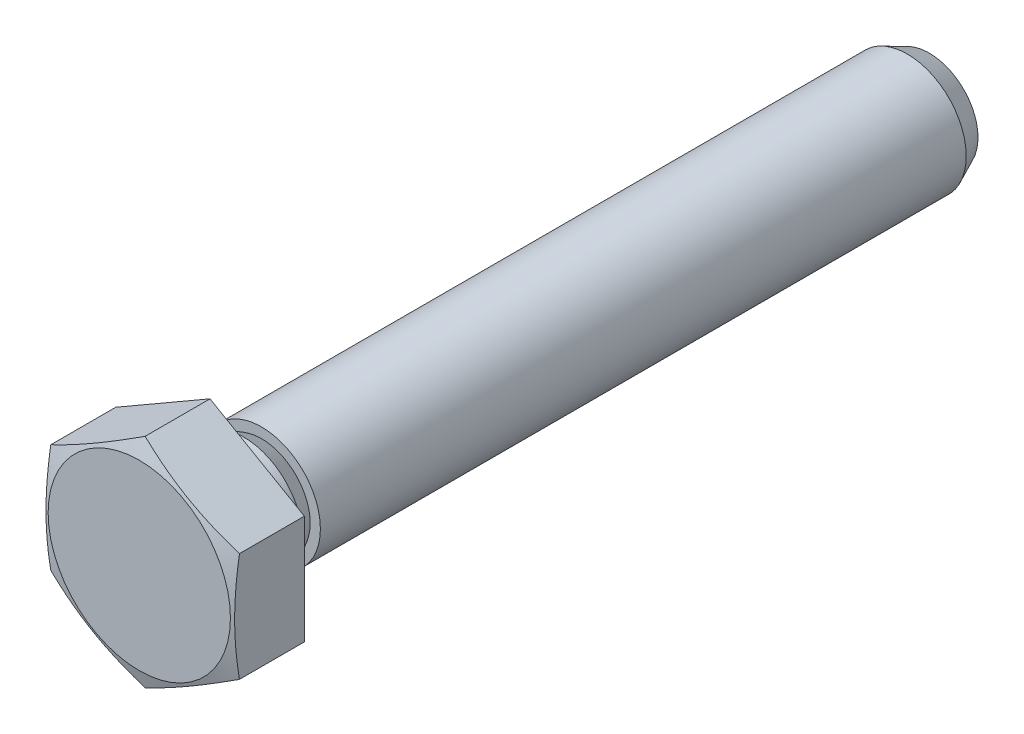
ISO-10303-21;
HEADER;
FILE_DESCRIPTION(('STEP AP214'),'2;1');
FILE_NAME('part.step','',(''),(''),'','','');
FILE_SCHEMA(('AUTOMOTIVE_DESIGN { 1 0 10303 214 1 1 1 1 }'));
ENDSEC;
DATA;
#1=APPLICATION_CONTEXT('core data for automotive mechanical design processes');
#2=APPLICATION_PROTOCOL_DEFINITION('international standard','automotive_design',2000,#1);
#3=PRODUCT_CONTEXT('',#1,'mechanical');
#4=PRODUCT('Part','Part','',(#3));
#5=PRODUCT_RELATED_PRODUCT_CATEGORY('part','',(#4));
#6=PRODUCT_DEFINITION_FORMATION('','',#4);
#7=PRODUCT_DEFINITION_CONTEXT('part definition',#1,'design');
#8=PRODUCT_DEFINITION('design','',#6,#7);
#9=PRODUCT_DEFINITION_SHAPE('','',#8);
#10=(LENGTH_UNIT() NAMED_UNIT(*) SI_UNIT(.MILLI.,.METRE.));
#11=(NAMED_UNIT(*) PLANE_ANGLE_UNIT() SI_UNIT($,.RADIAN.));
#12=(NAMED_UNIT(*) SI_UNIT($,.STERADIAN.) SOLID_ANGLE_UNIT());
#13=UNCERTAINTY_MEASURE_WITH_UNIT(LENGTH_MEASURE(1.E-05),#10,'distance_accuracy_value','');
#14=(GEOMETRIC_REPRESENTATION_CONTEXT(3) GLOBAL_UNCERTAINTY_ASSIGNED_CONTEXT((#13)) GLOBAL_UNIT_ASSIGNED_CONTEXT((#10,
#11,#12)) REPRESENTATION_CONTEXT('',''));
#15=CARTESIAN_POINT('',(0.,0.,0.));
#16=DIRECTION('',(0.,0.,1.));
#17=DIRECTION('',(1.,0.,0.));
#18=AXIS2_PLACEMENT_3D('',#15,#16,#17);
#19=CARTESIAN_POINT('',(0.,0.,0.5));
#20=DIRECTION('',(0.,0.,1.));
#21=DIRECTION('',(1.,0.,0.));
#22=AXIS2_PLACEMENT_3D('',#19,#20,#21);
#23=TOROIDAL_SURFACE('',#22,2.85,0.5);
#24=CARTESIAN_POINT('',(0.,0.,0.5));
#25=DIRECTION('',(0.,0.,1.));
#26=DIRECTION('',(1.,0.,0.));
#27=AXIS2_PLACEMENT_3D('',#24,#25,#26);
#28=CIRCLE('',#27,3.35);
#29=CARTESIAN_POINT('',(3.35,0.,0.500000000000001));
#30=VERTEX_POINT('',#29);
#31=EDGE_CURVE('E11',#30,#30,#28,.T.);
#32=ORIENTED_EDGE('',*,*,#31,.F.);
#33=EDGE_LOOP('',(#32));
#34=FACE_BOUND('',#33,.T.);
#35=CARTESIAN_POINT('',(0.,0.,0.));
#36=DIRECTION('',(0.,0.,1.));
#37=DIRECTION('',(1.,0.,0.));
#38=AXIS2_PLACEMENT_3D('',#35,#36,#37);
#39=CIRCLE('',#38,2.85);
#40=CARTESIAN_POINT('',(2.85,0.,0.));
#41=VERTEX_POINT('',#40);
#42=EDGE_CURVE('E24',#41,#41,#39,.T.);
#43=ORIENTED_EDGE('',*,*,#42,.T.);
#44=EDGE_LOOP('',(#43));
#45=FACE_BOUND('',#44,.T.);
#46=ADVANCED_FACE('F17',(#34,#45),#23,.T.);
#47=CARTESIAN_POINT('',(0.,2.84999999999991,0.));
#48=DIRECTION('',(0.,0.,-1.));
#49=DIRECTION('',(-1.,0.,0.));
#50=AXIS2_PLACEMENT_3D('',#47,#48,#49);
#51=PLANE('',#50);
#52=CARTESIAN_POINT('',(0.,0.,0.));
#53=DIRECTION('',(0.,0.,1.));
#54=DIRECTION('',(1.,0.,0.));
#55=AXIS2_PLACEMENT_3D('',#52,#53,#54);
#56=CIRCLE('',#55,2.75);
#57=CARTESIAN_POINT('',(2.75,0.,0.));
#58=VERTEX_POINT('',#57);
#59=EDGE_CURVE('E118',#58,#58,#56,.T.);
#60=ORIENTED_EDGE('',*,*,#59,.T.);
#61=EDGE_LOOP('',(#60));
#62=FACE_BOUND('',#61,.T.);
#63=ORIENTED_EDGE('',*,*,#42,.F.);
#64=EDGE_LOOP('',(#63));
#65=FACE_BOUND('',#64,.T.);
#66=ADVANCED_FACE('F124',(#62,#65),#51,.T.);
#67=CARTESIAN_POINT('',(0.,1.11022302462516E-13,-0.250000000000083));
#68=DIRECTION('',(0.,0.,1.));
#69=DIRECTION('',(1.,0.,0.));
#70=AXIS2_PLACEMENT_3D('',#67,#68,#69);
#71=TOROIDAL_SURFACE('',#70,2.75,0.25);
#72=CARTESIAN_POINT('',(0.,1.11022302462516E-13,-0.250000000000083));
#73=DIRECTION('',(0.,0.,1.));
#74=DIRECTION('',(1.,0.,0.));
#75=AXIS2_PLACEMENT_3D('',#72,#73,#74);
#76=CIRCLE('',#75,2.5);
#77=CARTESIAN_POINT('',(2.5,1.10476948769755E-13,-0.250000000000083));
#78=VERTEX_POINT('',#77);
#79=EDGE_CURVE('E115',#78,#78,#76,.T.);
#80=ORIENTED_EDGE('',*,*,#79,.T.);
#81=EDGE_LOOP('',(#80));
#82=FACE_BOUND('',#81,.T.);
#83=ORIENTED_EDGE('',*,*,#59,.F.);
#84=EDGE_LOOP('',(#83));
#85=FACE_BOUND('',#84,.T.);
#86=ADVANCED_FACE('F126',(#82,#85),#71,.F.);
#87=CARTESIAN_POINT('',(0.,0.,0.5));
#88=DIRECTION('',(0.,0.,1.));
#89=DIRECTION('',(1.,0.,0.));
#90=AXIS2_PLACEMENT_3D('',#87,#88,#89);
#91=CYLINDRICAL_SURFACE('',#90,2.5);
#92=CARTESIAN_POINT('',(0.,1.66533453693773E-13,-0.930022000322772));
#93=DIRECTION('',(0.,0.,1.));
#94=DIRECTION('',(1.,0.,0.));
#95=AXIS2_PLACEMENT_3D('',#92,#93,#94);
#96=CIRCLE('',#95,2.5);
#97=CARTESIAN_POINT('',(2.49999999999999,1.65988100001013E-13,-0.930022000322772));
#98=VERTEX_POINT('',#97);
#99=EDGE_CURVE('E112',#98,#98,#96,.T.);
#100=ORIENTED_EDGE('',*,*,#99,.T.);
#101=EDGE_LOOP('',(#100));
#102=FACE_BOUND('',#101,.T.);
#103=ORIENTED_EDGE('',*,*,#79,.F.);
#104=EDGE_LOOP('',(#103));
#105=FACE_BOUND('',#104,.T.);
#106=ADVANCED_FACE('F133',(#102,#105),#91,.T.);
#107=CARTESIAN_POINT('',(0.,1.66533453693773E-13,-0.930022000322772));
#108=DIRECTION('',(0.,0.,1.));
#109=DIRECTION('',(1.,0.,0.));
#110=AXIS2_PLACEMENT_3D('',#107,#108,#109);
#111=CONICAL_SURFACE('',#110,2.5,0.523598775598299);
#112=CARTESIAN_POINT('',(0.,0.,-1.68000000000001));
#113=DIRECTION('',(0.,0.,1.));
#114=DIRECTION('',(1.,0.,0.));
#115=AXIS2_PLACEMENT_3D('',#112,#113,#114);
#116=CIRCLE('',#115,2.067);
#117=CARTESIAN_POINT('',(2.067,0.,-1.68000000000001));
#118=VERTEX_POINT('',#117);
#119=EDGE_CURVE('E109',#118,#118,#116,.T.);
#120=ORIENTED_EDGE('',*,*,#119,.T.);
#121=EDGE_LOOP('',(#120));
#122=FACE_BOUND('',#121,.T.);
#123=ORIENTED_EDGE('',*,*,#99,.F.);
#124=EDGE_LOOP('',(#123));
#125=FACE_BOUND('',#124,.T.);
#126=ADVANCED_FACE('F140',(#122,#125),#111,.T.);
#127=CARTESIAN_POINT('',(0.,2.06700000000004,-1.68000000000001));
#128=DIRECTION('',(0.,0.,1.));
#129=DIRECTION('',(1.,0.,0.));
#130=AXIS2_PLACEMENT_3D('',#127,#128,#129);
#131=PLANE('',#130);
#132=CARTESIAN_POINT('',(0.,0.,-1.68000000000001));
#133=DIRECTION('',(0.,0.,1.));
#134=DIRECTION('',(1.,0.,0.));
#135=AXIS2_PLACEMENT_3D('',#132,#133,#134);
#136=CIRCLE('',#135,2.5);
#137=CARTESIAN_POINT('',(2.5,0.,-1.68000000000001));
#138=VERTEX_POINT('',#137);
#139=EDGE_CURVE('E106',#138,#138,#136,.T.);
#140=ORIENTED_EDGE('',*,*,#139,.T.);
#141=EDGE_LOOP('',(#140));
#142=FACE_BOUND('',#141,.T.);
#143=ORIENTED_EDGE('',*,*,#119,.F.);
#144=EDGE_LOOP('',(#143));
#145=FACE_BOUND('',#144,.T.);
#146=ADVANCED_FACE('F144',(#142,#145),#131,.T.);
#147=CARTESIAN_POINT('',(0.,0.,0.5));
#148=DIRECTION('',(0.,0.,1.));
#149=DIRECTION('',(1.,0.,0.));
#150=AXIS2_PLACEMENT_3D('',#147,#148,#149);
#151=CYLINDRICAL_SURFACE('',#150,2.5);
#152=CARTESIAN_POINT('',(0.,1.11022302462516E-13,-29.0670000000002));
#153=DIRECTION('',(0.,0.,1.));
#154=DIRECTION('',(1.,0.,0.));
#155=AXIS2_PLACEMENT_3D('',#152,#153,#154);
#156=CIRCLE('',#155,2.5);
#157=CARTESIAN_POINT('',(2.5,1.10476948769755E-13,-29.0670000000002));
#158=VERTEX_POINT('',#157);
#159=EDGE_CURVE('E103',#158,#158,#156,.T.);
#160=ORIENTED_EDGE('',*,*,#159,.T.);
#161=EDGE_LOOP('',(#160));
#162=FACE_BOUND('',#161,.T.);
#163=ORIENTED_EDGE('',*,*,#139,.F.);
#164=EDGE_LOOP('',(#163));
#165=FACE_BOUND('',#164,.T.);
#166=ADVANCED_FACE('F148',(#162,#165),#151,.T.);
#167=CARTESIAN_POINT('',(0.,1.11022302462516E-13,-29.0670000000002));
#168=DIRECTION('',(0.,0.,1.));
#169=DIRECTION('',(1.,0.,0.));
#170=AXIS2_PLACEMENT_3D('',#167,#168,#169);
#171=CONICAL_SURFACE('',#170,2.5,0.43451274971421);
#172=CARTESIAN_POINT('',(0.,-1.11022302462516E-13,-30.0000000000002));
#173=DIRECTION('',(0.,0.,1.));
#174=DIRECTION('',(1.,0.,0.));
#175=AXIS2_PLACEMENT_3D('',#172,#173,#174);
#176=CIRCLE('',#175,2.067);
#177=CARTESIAN_POINT('',(2.067,-1.1147320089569E-13,-30.0000000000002));
#178=VERTEX_POINT('',#177);
#179=EDGE_CURVE('E100',#178,#178,#176,.T.);
#180=ORIENTED_EDGE('',*,*,#179,.T.);
#181=EDGE_LOOP('',(#180));
#182=FACE_BOUND('',#181,.T.);
#183=ORIENTED_EDGE('',*,*,#159,.F.);
#184=EDGE_LOOP('',(#183));
#185=FACE_BOUND('',#184,.T.);
#186=ADVANCED_FACE('F152',(#182,#185),#171,.T.);
#187=CARTESIAN_POINT('',(0.,2.06700000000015,-30.));
#188=DIRECTION('',(0.,0.,-1.));
#189=DIRECTION('',(-1.,0.,0.));
#190=AXIS2_PLACEMENT_3D('',#187,#188,#189);
#191=PLANE('',#190);
#192=ORIENTED_EDGE('',*,*,#179,.F.);
#193=EDGE_LOOP('',(#192));
#194=FACE_BOUND('',#193,.T.);
#195=ADVANCED_FACE('F156',(#194),#191,.T.);
#196=CARTESIAN_POINT('',(-4.,-2.30940000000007,0.499999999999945));
#197=DIRECTION('',(0.,0.,-1.));
#198=DIRECTION('',(-1.,0.,0.));
#199=AXIS2_PLACEMENT_3D('',#196,#197,#198);
#200=PLANE('',#199);
#201=DIRECTION('',(0.,-1.,0.));
#202=VECTOR('',#201,1.);
#203=CARTESIAN_POINT('',(-4.,2.30940000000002,0.5));
#204=LINE('',#203,#202);
#205=CARTESIAN_POINT('',(-4.,2.30940000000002,0.5));
#206=VERTEX_POINT('',#205);
#207=CARTESIAN_POINT('',(-4.,-2.30940000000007,0.499999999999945));
#208=VERTEX_POINT('',#207);
#209=EDGE_CURVE('E83',#206,#208,#204,.T.);
#210=ORIENTED_EDGE('',*,*,#209,.F.);
#211=DIRECTION('',(0.866025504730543,0.49999982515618,0.));
#212=VECTOR('',#211,1.);
#213=CARTESIAN_POINT('',(-4.,2.30940000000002,0.5));
#214=LINE('',#213,#212);
#215=CARTESIAN_POINT('',(0.,4.61880000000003,0.499999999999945));
#216=VERTEX_POINT('',#215);
#217=EDGE_CURVE('E88',#206,#216,#214,.T.);
#218=ORIENTED_EDGE('',*,*,#217,.T.);
#219=DIRECTION('',(0.866025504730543,-0.499999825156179,0.));
#220=VECTOR('',#219,1.);
#221=CARTESIAN_POINT('',(0.,4.61880000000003,0.499999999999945));
#222=LINE('',#221,#220);
#223=CARTESIAN_POINT('',(4.00000000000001,2.30939999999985,0.499999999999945));
#224=VERTEX_POINT('',#223);
#225=EDGE_CURVE('E94',#216,#224,#222,.T.);
#226=ORIENTED_EDGE('',*,*,#225,.T.);
#227=DIRECTION('',(0.,-1.,0.));
#228=VECTOR('',#227,1.);
#229=CARTESIAN_POINT('',(4.00000000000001,2.30939999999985,0.499999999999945));
#230=LINE('',#229,#228);
#231=CARTESIAN_POINT('',(4.,-2.30939999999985,0.499999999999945));
#232=VERTEX_POINT('',#231);
#233=EDGE_CURVE('E246',#224,#232,#230,.T.);
#234=ORIENTED_EDGE('',*,*,#233,.T.);
#235=DIRECTION('',(-0.866025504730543,-0.49999982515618,0.));
#236=VECTOR('',#235,1.);
#237=CARTESIAN_POINT('',(4.,-2.30939999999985,0.499999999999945));
#238=LINE('',#237,#236);
#239=CARTESIAN_POINT('',(0.,-4.61880000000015,0.499999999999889));
#240=VERTEX_POINT('',#239);
#241=EDGE_CURVE('E232',#232,#240,#238,.T.);
#242=ORIENTED_EDGE('',*,*,#241,.T.);
#243=DIRECTION('',(-0.866025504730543,0.499999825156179,0.));
#244=VECTOR('',#243,1.);
#245=CARTESIAN_POINT('',(0.,-4.61880000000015,0.499999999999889));
#246=LINE('',#245,#244);
#247=EDGE_CURVE('E230',#240,#208,#246,.T.);
#248=ORIENTED_EDGE('',*,*,#247,.T.);
#249=EDGE_LOOP('',(#210,#218,#226,#234,#242,#248));
#250=FACE_BOUND('',#249,.T.);
#251=ORIENTED_EDGE('',*,*,#31,.T.);
#252=EDGE_LOOP('',(#251));
#253=FACE_BOUND('',#252,.T.);
#254=ADVANCED_FACE('F160',(#250,#253),#200,.T.);
#255=CARTESIAN_POINT('',(-4.,2.30940000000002,0.5));
#256=DIRECTION('',(-1.,0.,0.));
#257=DIRECTION('',(0.,0.,1.));
#258=AXIS2_PLACEMENT_3D('',#255,#256,#257);
#259=PLANE('',#258);
#260=CARTESIAN_POINT('',(-4.,2.66662995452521,3.19024582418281));
#261=CARTESIAN_POINT('',(-4.,2.48418475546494,3.22350153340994));
#262=CARTESIAN_POINT('',(-4.,2.30129241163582,3.25449531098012));
#263=CARTESIAN_POINT('',(-4.,1.93455333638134,3.31090755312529));
#264=CARTESIAN_POINT('',(-4.,1.75070613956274,3.33632297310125));
#265=CARTESIAN_POINT('',(-4.,1.38237526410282,3.38046702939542));
#266=CARTESIAN_POINT('',(-4.,1.19789237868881,3.39920214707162));
#267=CARTESIAN_POINT('',(-4.,0.82833495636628,3.42902381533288));
#268=CARTESIAN_POINT('',(-4.,0.643260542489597,3.44011186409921));
#269=CARTESIAN_POINT('',(-4.,0.275434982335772,3.45386479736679));
#270=CARTESIAN_POINT('',(-4.,0.0926883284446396,3.45664750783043));
#271=CARTESIAN_POINT('',(-4.,-0.272751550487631,3.45394498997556));
#272=CARTESIAN_POINT('',(-4.,-0.455444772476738,3.44845935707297));
#273=CARTESIAN_POINT('',(-4.,-0.820363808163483,3.42957062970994));
#274=CARTESIAN_POINT('',(-4.,-1.00258973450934,3.41616966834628));
#275=CARTESIAN_POINT('',(-4.00000000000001,-1.36636648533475,3.38222173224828));
#276=CARTESIAN_POINT('',(-4.00000000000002,-1.5479172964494,3.36167461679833));
#277=CARTESIAN_POINT('',(-4.00000000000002,-1.91302688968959,3.31405859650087));
#278=CARTESIAN_POINT('',(-4.00000000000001,-2.0965728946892,3.28689308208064));
#279=CARTESIAN_POINT('',(-4.,-2.4627981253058,3.22728932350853));
#280=CARTESIAN_POINT('',(-4.,-2.64547734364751,3.19485103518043));
#281=CARTESIAN_POINT('',(-4.,-3.01014914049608,3.12565761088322));
#282=CARTESIAN_POINT('',(-4.,-3.19214111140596,3.08889930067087));
#283=CARTESIAN_POINT('',(-4.,-3.55539222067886,3.01191845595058));
#284=CARTESIAN_POINT('',(-4.,-3.73665133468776,2.97169580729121));
#285=CARTESIAN_POINT('',(-4.,-4.10158174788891,2.88776479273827));
#286=CARTESIAN_POINT('',(-4.,-4.28524209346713,2.84400903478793));
#287=CARTESIAN_POINT('',(-4.,-4.65199720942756,2.75418610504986));
#288=CARTESIAN_POINT('',(-4.,-4.83509197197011,2.70811890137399));
#289=CARTESIAN_POINT('',(-4.,-5.20040952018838,2.61422409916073));
#290=CARTESIAN_POINT('',(-4.,-5.38263333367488,2.56640048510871));
#291=CARTESIAN_POINT('',(-4.,-5.74666325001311,2.46923414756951));
#292=CARTESIAN_POINT('',(-3.99999999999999,-5.92846937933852,2.41989152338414));
#293=CARTESIAN_POINT('',(-3.99999999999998,-6.11010870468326,2.36995326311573));
#294=B_SPLINE_CURVE_WITH_KNOTS('',3,(#260,#261,#262,#263,#264,#265,#266,#267,#268,#269,#270,
#271,#272,#273,#274,#275,#276,#277,#278,#279,#280,#281,#282,#283,#284,#285,#286,#287,#288,#289,
#290,#291,#292,#293),.UNSPECIFIED.,.F.,.F.,(4,2,2,2,2,2,2,2,2,2,2,2,2,2,2,2,4),(0.,
0.556391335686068,1.11308559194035,1.66923825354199,2.2252819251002,2.77339872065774,
3.32154233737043,3.86953830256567,4.41754505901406,4.97408860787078,5.5306368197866,
6.08759655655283,6.64457465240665,7.21095819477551,7.77734955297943,8.3425270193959,
8.90766761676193),.UNSPECIFIED.);
#295=CARTESIAN_POINT('',(-4.,2.30940000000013,3.25223131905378));
#296=VERTEX_POINT('',#295);
#297=CARTESIAN_POINT('',(-4.,-2.30940000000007,3.25223131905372));
#298=VERTEX_POINT('',#297);
#299=EDGE_CURVE('E72',#296,#298,#294,.T.);
#300=ORIENTED_EDGE('',*,*,#299,.F.);
#301=DIRECTION('',(0.,0.,1.));
#302=VECTOR('',#301,1.);
#303=CARTESIAN_POINT('',(-4.,2.30940000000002,0.5));
#304=LINE('',#303,#302);
#305=EDGE_CURVE('E81',#206,#296,#304,.T.);
#306=ORIENTED_EDGE('',*,*,#305,.F.);
#307=ORIENTED_EDGE('',*,*,#209,.T.);
#308=DIRECTION('',(0.,0.,1.));
#309=VECTOR('',#308,1.);
#310=CARTESIAN_POINT('',(-4.,-2.30940000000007,0.499999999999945));
#311=LINE('',#310,#309);
#312=EDGE_CURVE('E39',#208,#298,#311,.T.);
#313=ORIENTED_EDGE('',*,*,#312,.T.);
#314=EDGE_LOOP('',(#300,#306,#307,#313));
#315=FACE_BOUND('',#314,.T.);
#316=ADVANCED_FACE('F79',(#315),#259,.T.);
#317=CARTESIAN_POINT('',(0.,-4.61880000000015,0.499999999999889));
#318=DIRECTION('',(0.499999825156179,0.866025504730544,0.));
#319=DIRECTION('',(0.866025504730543,-0.499999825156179,0.));
#320=AXIS2_PLACEMENT_3D('',#317,#318,#319);
#321=PLANE('',#320);
#322=DIRECTION('',(0.,0.,1.));
#323=VECTOR('',#322,1.);
#324=CARTESIAN_POINT('',(0.,-4.61880000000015,0.499999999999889));
#325=LINE('',#324,#323);
#326=CARTESIAN_POINT('',(0.,-4.61879999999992,3.252231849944));
#327=VERTEX_POINT('',#326);
#328=EDGE_CURVE('E237',#240,#327,#325,.T.);
#329=ORIENTED_EDGE('',*,*,#328,.T.);
#330=CARTESIAN_POINT('',(1.99999995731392E-07,-4.61880011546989,3.25223181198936));
#331=CARTESIAN_POINT('',(-0.165833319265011,-4.5230561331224,3.28371353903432));
#332=CARTESIAN_POINT('',(-0.33211539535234,-4.42705317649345,3.31232833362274));
#333=CARTESIAN_POINT('',(-0.665562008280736,-4.23453777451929,3.36264341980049));
#334=CARTESIAN_POINT('',(-0.832727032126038,-4.13802504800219,3.38433937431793));
#335=CARTESIAN_POINT('',(-1.16642181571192,-3.94536636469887,3.41945743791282));
#336=CARTESIAN_POINT('',(-1.3329464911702,-3.84922334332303,3.43294223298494));
#337=CARTESIAN_POINT('',(-1.66631419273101,-3.6567535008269,3.45102704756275));
#338=CARTESIAN_POINT('',(-1.83315710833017,-3.56042674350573,3.45562973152));
#339=CARTESIAN_POINT('',(-2.16684293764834,-3.36777322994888,3.45562967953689));
#340=CARTESIAN_POINT('',(-2.33368585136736,-3.27144647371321,3.45102694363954));
#341=CARTESIAN_POINT('',(-2.6670535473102,-3.0789766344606,3.43294202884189));
#342=CARTESIAN_POINT('',(-2.83357821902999,-2.98283361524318,3.41945718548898));
#343=CARTESIAN_POINT('',(-3.16727299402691,-2.79017493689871,3.38433903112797));
#344=CARTESIAN_POINT('',(-3.33443801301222,-2.69366221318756,3.3626430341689));
#345=CARTESIAN_POINT('',(-3.6678846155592,-2.50114681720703,3.31232787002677));
#346=CARTESIAN_POINT('',(-3.83416668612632,-2.40514386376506,3.28371303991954));
#347=CARTESIAN_POINT('',(-4.0000002,-2.30939988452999,3.25223128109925));
#348=B_SPLINE_CURVE_WITH_KNOTS('',3,(#330,#331,#332,#333,#334,#335,#336,#337,#338,#339,#340,
#341,#342,#343,#344,#345,#346,#347),.UNSPECIFIED.,.F.,.F.,(4,2,2,2,2,2,2,2,4),(0.,
0.582223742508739,1.16481173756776,1.74289445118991,2.32080372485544,2.89871299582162,
3.47679570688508,4.05938369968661,4.64160743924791),.UNSPECIFIED.);
#349=EDGE_CURVE('E84',#327,#298,#348,.T.);
#350=ORIENTED_EDGE('',*,*,#349,.T.);
#351=ORIENTED_EDGE('',*,*,#312,.F.);
#352=ORIENTED_EDGE('',*,*,#247,.F.);
#353=EDGE_LOOP('',(#329,#350,#351,#352));
#354=FACE_BOUND('',#353,.T.);
#355=ADVANCED_FACE('F165',(#354),#321,.F.);
#356=CARTESIAN_POINT('',(4.,-2.30939999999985,0.499999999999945));
#357=DIRECTION('',(-0.499999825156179,0.866025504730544,0.));
#358=DIRECTION('',(0.866025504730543,0.49999982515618,0.));
#359=AXIS2_PLACEMENT_3D('',#356,#357,#358);
#360=PLANE('',#359);
#361=DIRECTION('',(0.,0.,1.));
#362=VECTOR('',#361,1.);
#363=CARTESIAN_POINT('',(4.,-2.30939999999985,0.499999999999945));
#364=LINE('',#363,#362);
#365=CARTESIAN_POINT('',(3.99999999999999,-2.30940000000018,3.25223131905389));
#366=VERTEX_POINT('',#365);
#367=EDGE_CURVE('E240',#232,#366,#364,.T.);
#368=ORIENTED_EDGE('',*,*,#367,.T.);
#369=CARTESIAN_POINT('',(4.00000019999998,-2.30939988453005,3.25223128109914));
#370=CARTESIAN_POINT('',(3.83416668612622,-2.40514386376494,3.28371303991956));
#371=CARTESIAN_POINT('',(3.66788461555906,-2.50114681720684,3.31232787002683));
#372=CARTESIAN_POINT('',(3.33443801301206,-2.69366221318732,3.362643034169));
#373=CARTESIAN_POINT('',(3.16727299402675,-2.7901749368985,3.38433903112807));
#374=CARTESIAN_POINT('',(2.83357821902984,-2.98283361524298,3.41945718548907));
#375=CARTESIAN_POINT('',(2.66705354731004,-3.0789766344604,3.43294202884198));
#376=CARTESIAN_POINT('',(2.3336858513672,-3.271446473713,3.45102694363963));
#377=CARTESIAN_POINT('',(2.16684293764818,-3.36777322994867,3.45562967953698));
#378=CARTESIAN_POINT('',(1.83315710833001,-3.56042674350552,3.45562973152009));
#379=CARTESIAN_POINT('',(1.66631419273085,-3.65675350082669,3.45102704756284));
#380=CARTESIAN_POINT('',(1.33294649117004,-3.84922334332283,3.43294223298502));
#381=CARTESIAN_POINT('',(1.16642181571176,-3.94536636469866,3.41945743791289));
#382=CARTESIAN_POINT('',(0.832727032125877,-4.13802504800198,3.38433937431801));
#383=CARTESIAN_POINT('',(0.665562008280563,-4.23453777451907,3.36264341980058));
#384=CARTESIAN_POINT('',(0.33211539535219,-4.42705317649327,3.3123283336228));
#385=CARTESIAN_POINT('',(0.165833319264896,-4.52305613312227,3.28371353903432));
#386=CARTESIAN_POINT('',(-2.00000020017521E-07,-4.61880011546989,3.25223181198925));
#387=B_SPLINE_CURVE_WITH_KNOTS('',3,(#369,#370,#371,#372,#373,#374,#375,#376,#377,#378,#379,
#380,#381,#382,#383,#384,#385,#386),.UNSPECIFIED.,.F.,.F.,(4,2,2,2,2,2,2,2,4),(0.,
0.582223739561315,1.16481173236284,1.7428944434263,2.32080371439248,2.89871298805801,
3.47679570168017,4.05938369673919,4.64160743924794),.UNSPECIFIED.);
#388=EDGE_CURVE('E203',#366,#327,#387,.T.);
#389=ORIENTED_EDGE('',*,*,#388,.T.);
#390=ORIENTED_EDGE('',*,*,#328,.F.);
#391=ORIENTED_EDGE('',*,*,#241,.F.);
#392=EDGE_LOOP('',(#368,#389,#390,#391));
#393=FACE_BOUND('',#392,.T.);
#394=ADVANCED_FACE('F208',(#393),#360,.F.);
#395=CARTESIAN_POINT('',(4.00000000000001,2.30939999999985,0.499999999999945));
#396=DIRECTION('',(-1.,0.,0.));
#397=DIRECTION('',(0.,0.,1.));
#398=AXIS2_PLACEMENT_3D('',#395,#396,#397);
#399=PLANE('',#398);
#400=DIRECTION('',(0.,0.,1.));
#401=VECTOR('',#400,1.);
#402=CARTESIAN_POINT('',(4.00000000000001,2.30939999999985,0.499999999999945));
#403=LINE('',#402,#401);
#404=CARTESIAN_POINT('',(4.,2.30939999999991,3.25223131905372));
#405=VERTEX_POINT('',#404);
#406=EDGE_CURVE('E92',#224,#405,#403,.T.);
#407=ORIENTED_EDGE('',*,*,#406,.T.);
#408=CARTESIAN_POINT('',(3.99999999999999,2.66662995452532,3.19024582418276));
#409=CARTESIAN_POINT('',(4.,2.48418475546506,3.22350153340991));
#410=CARTESIAN_POINT('',(4.00000000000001,2.30129241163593,3.2544953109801));
#411=CARTESIAN_POINT('',(4.00000000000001,1.93455333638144,3.31090755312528));
#412=CARTESIAN_POINT('',(4.00000000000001,1.75070613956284,3.33632297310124));
#413=CARTESIAN_POINT('',(4.00000000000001,1.38237526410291,3.38046702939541));
#414=CARTESIAN_POINT('',(4.00000000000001,1.19789237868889,3.39920214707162));
#415=CARTESIAN_POINT('',(4.00000000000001,0.828334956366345,3.42902381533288));
#416=CARTESIAN_POINT('',(4.00000000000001,0.643260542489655,3.44011186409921));
#417=CARTESIAN_POINT('',(4.00000000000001,0.27543498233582,3.45386479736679));
#418=CARTESIAN_POINT('',(4.00000000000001,0.092688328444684,3.45664750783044));
#419=CARTESIAN_POINT('',(4.00000000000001,-0.272751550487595,3.45394498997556));
#420=CARTESIAN_POINT('',(4.00000000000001,-0.455444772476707,3.44845935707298));
#421=CARTESIAN_POINT('',(4.00000000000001,-0.82036380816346,3.42957062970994));
#422=CARTESIAN_POINT('',(4.00000000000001,-1.00258973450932,3.41616966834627));
#423=CARTESIAN_POINT('',(4.00000000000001,-1.36636648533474,3.3822217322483));
#424=CARTESIAN_POINT('',(4.,-1.54791729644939,3.36167461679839));
#425=CARTESIAN_POINT('',(4.,-1.91302688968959,3.31405859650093));
#426=CARTESIAN_POINT('',(4.00000000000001,-2.0965728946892,3.28689308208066));
#427=CARTESIAN_POINT('',(4.00000000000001,-2.4627981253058,3.22728932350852));
#428=CARTESIAN_POINT('',(4.00000000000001,-2.64547734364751,3.19485103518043));
#429=CARTESIAN_POINT('',(4.00000000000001,-3.01014914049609,3.12565761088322));
#430=CARTESIAN_POINT('',(4.00000000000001,-3.19214111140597,3.08889930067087));
#431=CARTESIAN_POINT('',(4.00000000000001,-3.55539222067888,3.01191845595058));
#432=CARTESIAN_POINT('',(4.00000000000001,-3.73665133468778,2.97169580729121));
#433=CARTESIAN_POINT('',(4.00000000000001,-4.10158174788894,2.88776479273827));
#434=CARTESIAN_POINT('',(4.00000000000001,-4.28524209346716,2.84400903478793));
#435=CARTESIAN_POINT('',(4.00000000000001,-4.6519972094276,2.75418610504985));
#436=CARTESIAN_POINT('',(4.00000000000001,-4.83509197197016,2.70811890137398));
#437=CARTESIAN_POINT('',(4.00000000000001,-5.20040952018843,2.61422409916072));
#438=CARTESIAN_POINT('',(4.00000000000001,-5.38263333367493,2.5664004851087));
#439=CARTESIAN_POINT('',(4.00000000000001,-5.74666325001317,2.46923414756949));
#440=CARTESIAN_POINT('',(4.00000000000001,-5.92846937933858,2.41989152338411));
#441=CARTESIAN_POINT('',(4.00000000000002,-6.11010870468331,2.36995326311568));
#442=B_SPLINE_CURVE_WITH_KNOTS('',3,(#408,#409,#410,#411,#412,#413,#414,#415,#416,#417,#418,
#419,#420,#421,#422,#423,#424,#425,#426,#427,#428,#429,#430,#431,#432,#433,#434,#435,#436,#437,
#438,#439,#440,#441),.UNSPECIFIED.,.F.,.F.,(4,2,2,2,2,2,2,2,2,2,2,2,2,2,2,2,4),(0.,
0.556391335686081,1.11308559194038,1.66923825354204,2.22528192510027,2.77339872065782,
3.32154233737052,3.86953830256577,4.41754505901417,4.9740886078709,5.53063681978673,
6.08759655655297,6.6445746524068,7.21095819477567,7.7773495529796,8.34252701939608,
8.90766761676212),.UNSPECIFIED.);
#443=EDGE_CURVE('E198',#405,#366,#442,.T.);
#444=ORIENTED_EDGE('',*,*,#443,.T.);
#445=ORIENTED_EDGE('',*,*,#367,.F.);
#446=ORIENTED_EDGE('',*,*,#233,.F.);
#447=EDGE_LOOP('',(#407,#444,#445,#446));
#448=FACE_BOUND('',#447,.T.);
#449=ADVANCED_FACE('F211',(#448),#399,.F.);
#450=CARTESIAN_POINT('',(0.,4.61880000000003,0.499999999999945));
#451=DIRECTION('',(-0.499999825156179,-0.866025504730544,0.));
#452=DIRECTION('',(-0.866025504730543,0.499999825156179,0.));
#453=AXIS2_PLACEMENT_3D('',#450,#451,#452);
#454=PLANE('',#453);
#455=DIRECTION('',(0.,0.,1.));
#456=VECTOR('',#455,1.);
#457=CARTESIAN_POINT('',(0.,4.61880000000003,0.499999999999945));
#458=LINE('',#457,#456);
#459=CARTESIAN_POINT('',(0.,4.61879999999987,3.25223184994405));
#460=VERTEX_POINT('',#459);
#461=EDGE_CURVE('E90',#216,#460,#458,.T.);
#462=ORIENTED_EDGE('',*,*,#461,.T.);
#463=CARTESIAN_POINT('',(-2.00000002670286E-07,4.61880011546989,3.2522318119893));
#464=CARTESIAN_POINT('',(0.165833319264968,4.52305613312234,3.28371353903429));
#465=CARTESIAN_POINT('',(0.332115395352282,4.42705317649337,3.31232833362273));
#466=CARTESIAN_POINT('',(0.665562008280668,4.23453777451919,3.36264341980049));
#467=CARTESIAN_POINT('',(0.832727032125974,4.13802504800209,3.38433937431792));
#468=CARTESIAN_POINT('',(1.16642181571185,3.94536636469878,3.41945743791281));
#469=CARTESIAN_POINT('',(1.33294649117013,3.84922334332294,3.43294223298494));
#470=CARTESIAN_POINT('',(1.66631419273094,3.65675350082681,3.45102704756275));
#471=CARTESIAN_POINT('',(1.8331571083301,3.56042674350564,3.45562973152));
#472=CARTESIAN_POINT('',(2.16684293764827,3.36777322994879,3.4556296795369));
#473=CARTESIAN_POINT('',(2.33368585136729,3.27144647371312,3.45102694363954));
#474=CARTESIAN_POINT('',(2.66705354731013,3.07897663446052,3.4329420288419));
#475=CARTESIAN_POINT('',(2.83357821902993,2.9828336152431,3.41945718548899));
#476=CARTESIAN_POINT('',(3.16727299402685,2.79017493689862,3.38433903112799));
#477=CARTESIAN_POINT('',(3.33443801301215,2.69366221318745,3.36264303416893));
#478=CARTESIAN_POINT('',(3.66788461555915,2.50114681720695,3.31232787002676));
#479=CARTESIAN_POINT('',(3.83416668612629,2.40514386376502,3.28371303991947));
#480=CARTESIAN_POINT('',(4.0000002,2.30939988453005,3.25223128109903));
#481=B_SPLINE_CURVE_WITH_KNOTS('',3,(#463,#464,#465,#466,#467,#468,#469,#470,#471,#472,#473,
#474,#475,#476,#477,#478,#479,#480),.UNSPECIFIED.,.F.,.F.,(4,2,2,2,2,2,2,2,4),(0.,
0.582223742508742,1.16481173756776,1.74289445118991,2.32080372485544,2.89871299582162,
3.47679570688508,4.05938369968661,4.64160743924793),.UNSPECIFIED.);
#482=EDGE_CURVE('E31',#460,#405,#481,.T.);
#483=ORIENTED_EDGE('',*,*,#482,.T.);
#484=ORIENTED_EDGE('',*,*,#406,.F.);
#485=ORIENTED_EDGE('',*,*,#225,.F.);
#486=EDGE_LOOP('',(#462,#483,#484,#485));
#487=FACE_BOUND('',#486,.T.);
#488=ADVANCED_FACE('F215',(#487),#454,.F.);
#489=CARTESIAN_POINT('',(-4.,2.30940000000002,0.5));
#490=DIRECTION('',(0.499999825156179,-0.866025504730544,0.));
#491=DIRECTION('',(-0.866025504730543,-0.49999982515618,0.));
#492=AXIS2_PLACEMENT_3D('',#489,#490,#491);
#493=PLANE('',#492);
#494=ORIENTED_EDGE('',*,*,#305,.T.);
#495=CARTESIAN_POINT('',(-4.00000020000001,2.30939988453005,3.25223128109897));
#496=CARTESIAN_POINT('',(-3.83416668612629,2.40514386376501,3.28371303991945));
#497=CARTESIAN_POINT('',(-3.66788461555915,2.50114681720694,3.31232787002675));
#498=CARTESIAN_POINT('',(-3.33443801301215,2.69366221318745,3.36264303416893));
#499=CARTESIAN_POINT('',(-3.16727299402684,2.79017493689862,3.38433903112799));
#500=CARTESIAN_POINT('',(-2.83357821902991,2.9828336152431,3.41945718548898));
#501=CARTESIAN_POINT('',(-2.66705354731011,3.07897663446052,3.4329420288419));
#502=CARTESIAN_POINT('',(-2.33368585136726,3.27144647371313,3.45102694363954));
#503=CARTESIAN_POINT('',(-2.16684293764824,3.3677732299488,3.4556296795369));
#504=CARTESIAN_POINT('',(-1.83315710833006,3.56042674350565,3.45562973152));
#505=CARTESIAN_POINT('',(-1.6663141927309,3.65675350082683,3.45102704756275));
#506=CARTESIAN_POINT('',(-1.33294649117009,3.84922334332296,3.43294223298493));
#507=CARTESIAN_POINT('',(-1.16642181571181,3.9453663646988,3.41945743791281));
#508=CARTESIAN_POINT('',(-0.832727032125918,4.13802504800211,3.38433937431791));
#509=CARTESIAN_POINT('',(-0.665562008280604,4.2345377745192,3.36264341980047));
#510=CARTESIAN_POINT('',(-0.332115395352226,4.42705317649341,3.31232833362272));
#511=CARTESIAN_POINT('',(-0.165833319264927,4.52305613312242,3.2837135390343));
#512=CARTESIAN_POINT('',(2.00000002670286E-07,4.61880011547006,3.25223181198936));
#513=B_SPLINE_CURVE_WITH_KNOTS('',3,(#495,#496,#497,#498,#499,#500,#501,#502,#503,#504,#505,
#506,#507,#508,#509,#510,#511,#512),.UNSPECIFIED.,.F.,.F.,(4,2,2,2,2,2,2,2,4),(0.,
0.582223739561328,1.16481173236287,1.74289444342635,2.32080371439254,2.89871298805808,
3.47679570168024,4.05938369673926,4.64160743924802),.UNSPECIFIED.);
#514=EDGE_CURVE('E68',#296,#460,#513,.T.);
#515=ORIENTED_EDGE('',*,*,#514,.T.);
#516=ORIENTED_EDGE('',*,*,#461,.F.);
#517=ORIENTED_EDGE('',*,*,#217,.F.);
#518=EDGE_LOOP('',(#494,#515,#516,#517));
#519=FACE_BOUND('',#518,.T.);
#520=ADVANCED_FACE('F86',(#519),#493,.F.);
#521=CARTESIAN_POINT('',(0.,0.,3.22186818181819));
#522=DIRECTION('',(0.,0.,-1.));
#523=DIRECTION('',(-1.,0.,0.));
#524=AXIS2_PLACEMENT_3D('',#521,#522,#523);
#525=CONICAL_SURFACE('',#524,4.711176,1.25322470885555);
#526=ORIENTED_EDGE('',*,*,#299,.T.);
#527=ORIENTED_EDGE('',*,*,#349,.F.);
#528=ORIENTED_EDGE('',*,*,#388,.F.);
#529=ORIENTED_EDGE('',*,*,#443,.F.);
#530=ORIENTED_EDGE('',*,*,#482,.F.);
#531=ORIENTED_EDGE('',*,*,#514,.F.);
#532=EDGE_LOOP('',(#526,#527,#528,#529,#530,#531));
#533=FACE_BOUND('',#532,.T.);
#534=CARTESIAN_POINT('',(0.,0.,3.5));
#535=DIRECTION('',(0.,0.,-1.));
#536=DIRECTION('',(-1.,0.,0.));
#537=AXIS2_PLACEMENT_3D('',#534,#535,#536);
#538=CIRCLE('',#537,3.86500995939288);
#539=CARTESIAN_POINT('',(-3.86500995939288,0.,3.5));
#540=VERTEX_POINT('',#539);
#541=EDGE_CURVE('E76',#540,#540,#538,.F.);
#542=ORIENTED_EDGE('',*,*,#541,.F.);
#543=EDGE_LOOP('',(#542));
#544=FACE_BOUND('',#543,.T.);
#545=ADVANCED_FACE('F70',(#533,#544),#525,.T.);
#546=CARTESIAN_POINT('',(-4.00000000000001,-2.30940000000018,3.49999999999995));
#547=DIRECTION('',(0.,0.,-1.));
#548=DIRECTION('',(-1.,0.,0.));
#549=AXIS2_PLACEMENT_3D('',#546,#547,#548);
#550=PLANE('',#549);
#551=ORIENTED_EDGE('',*,*,#541,.T.);
#552=EDGE_LOOP('',(#551));
#553=FACE_BOUND('',#552,.T.);
#554=ADVANCED_FACE('F181',(#553),#550,.F.);
#555=CLOSED_SHELL('',(#46,#66,#86,#106,#126,#146,#166,#186,#195,#254,#316,#355,#394,#449,#488,
#520,#545,#554));
#556=MANIFOLD_SOLID_BREP('B1',#555);
#557=ADVANCED_BREP_SHAPE_REPRESENTATION('',(#18,#556),#14);
#558=SHAPE_DEFINITION_REPRESENTATION(#9,#557);
ENDSEC;
END-ISO-10303-21;
